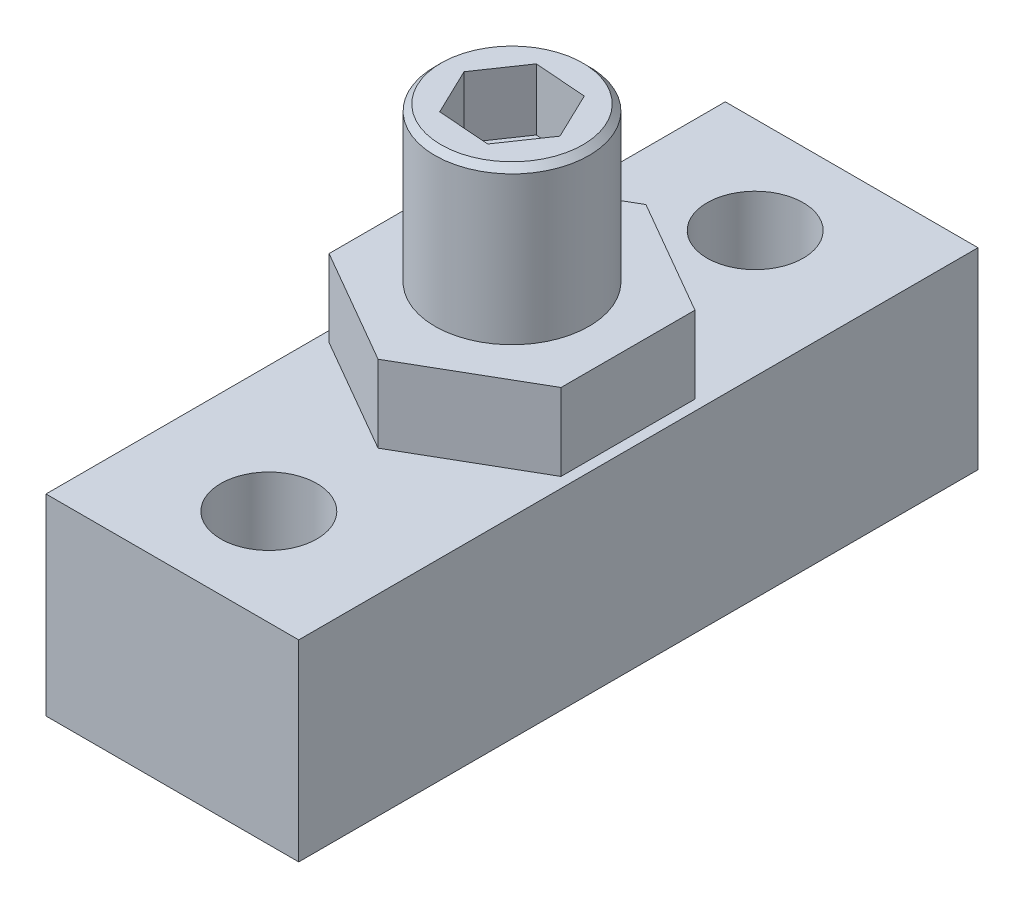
ISO-10303-21;
HEADER;
FILE_DESCRIPTION(('STEP AP214'),'2;1');
FILE_NAME('part.step','',(''),(''),'','','');
FILE_SCHEMA(('AUTOMOTIVE_DESIGN { 1 0 10303 214 1 1 1 1 }'));
ENDSEC;
DATA;
#1=APPLICATION_CONTEXT('core data for automotive mechanical design processes');
#2=APPLICATION_PROTOCOL_DEFINITION('international standard','automotive_design',2000,#1);
#3=PRODUCT_CONTEXT('',#1,'mechanical');
#4=PRODUCT('Part','Part','',(#3));
#5=PRODUCT_RELATED_PRODUCT_CATEGORY('part','',(#4));
#6=PRODUCT_DEFINITION_FORMATION('','',#4);
#7=PRODUCT_DEFINITION_CONTEXT('part definition',#1,'design');
#8=PRODUCT_DEFINITION('design','',#6,#7);
#9=PRODUCT_DEFINITION_SHAPE('','',#8);
#10=(LENGTH_UNIT() NAMED_UNIT(*) SI_UNIT(.MILLI.,.METRE.));
#11=(NAMED_UNIT(*) PLANE_ANGLE_UNIT() SI_UNIT($,.RADIAN.));
#12=(NAMED_UNIT(*) SI_UNIT($,.STERADIAN.) SOLID_ANGLE_UNIT());
#13=UNCERTAINTY_MEASURE_WITH_UNIT(LENGTH_MEASURE(1.E-05),#10,'distance_accuracy_value','');
#14=(GEOMETRIC_REPRESENTATION_CONTEXT(3) GLOBAL_UNCERTAINTY_ASSIGNED_CONTEXT((#13)) GLOBAL_UNIT_ASSIGNED_CONTEXT((#10,
#11,#12)) REPRESENTATION_CONTEXT('',''));
#15=CARTESIAN_POINT('',(0.,0.,0.));
#16=DIRECTION('',(0.,0.,1.));
#17=DIRECTION('',(1.,0.,0.));
#18=AXIS2_PLACEMENT_3D('',#15,#16,#17);
#19=CARTESIAN_POINT('',(0.,7.1374,5.51860215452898));
#20=DIRECTION('',(0.,1.,0.));
#21=DIRECTION('',(0.,0.,1.));
#22=AXIS2_PLACEMENT_3D('',#19,#20,#21);
#23=PLANE('',#22);
#24=DIRECTION('',(0.866025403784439,0.,0.5));
#25=VECTOR('',#24,1.);
#26=CARTESIAN_POINT('',(-4.77924965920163,7.1374,2.75930107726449));
#27=LINE('',#26,#25);
#28=CARTESIAN_POINT('',(-4.77924965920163,7.1374,2.75930107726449));
#29=VERTEX_POINT('',#28);
#30=CARTESIAN_POINT('',(0.,7.1374,5.51860215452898));
#31=VERTEX_POINT('',#30);
#32=EDGE_CURVE('E216',#29,#31,#27,.T.);
#33=ORIENTED_EDGE('',*,*,#32,.T.);
#34=DIRECTION('',(0.866025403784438,0.,-0.500000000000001));
#35=VECTOR('',#34,1.);
#36=CARTESIAN_POINT('',(0.,7.1374,5.51860215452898));
#37=LINE('',#36,#35);
#38=CARTESIAN_POINT('',(4.77924965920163,7.1374,2.75930107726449));
#39=VERTEX_POINT('',#38);
#40=EDGE_CURVE('E219',#31,#39,#37,.T.);
#41=ORIENTED_EDGE('',*,*,#40,.T.);
#42=DIRECTION('',(0.,0.,-1.));
#43=VECTOR('',#42,1.);
#44=CARTESIAN_POINT('',(4.77924965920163,7.1374,2.75930107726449));
#45=LINE('',#44,#43);
#46=CARTESIAN_POINT('',(4.77924965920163,7.1374,-2.75930107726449));
#47=VERTEX_POINT('',#46);
#48=EDGE_CURVE('E221',#39,#47,#45,.T.);
#49=ORIENTED_EDGE('',*,*,#48,.T.);
#50=DIRECTION('',(-0.866025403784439,0.,-0.5));
#51=VECTOR('',#50,1.);
#52=CARTESIAN_POINT('',(4.77924965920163,7.1374,-2.75930107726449));
#53=LINE('',#52,#51);
#54=CARTESIAN_POINT('',(0.,7.1374,-5.51860215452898));
#55=VERTEX_POINT('',#54);
#56=EDGE_CURVE('E223',#47,#55,#53,.T.);
#57=ORIENTED_EDGE('',*,*,#56,.T.);
#58=DIRECTION('',(-0.866025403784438,0.,0.500000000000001));
#59=VECTOR('',#58,1.);
#60=CARTESIAN_POINT('',(0.,7.1374,-5.51860215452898));
#61=LINE('',#60,#59);
#62=CARTESIAN_POINT('',(-4.77924965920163,7.1374,-2.75930107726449));
#63=VERTEX_POINT('',#62);
#64=EDGE_CURVE('E225',#55,#63,#61,.T.);
#65=ORIENTED_EDGE('',*,*,#64,.T.);
#66=DIRECTION('',(0.,0.,1.));
#67=VECTOR('',#66,1.);
#68=CARTESIAN_POINT('',(-4.77924965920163,7.1374,-2.75930107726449));
#69=LINE('',#68,#67);
#70=EDGE_CURVE('E227',#63,#29,#69,.T.);
#71=ORIENTED_EDGE('',*,*,#70,.T.);
#72=EDGE_LOOP('',(#33,#41,#49,#57,#65,#71));
#73=FACE_BOUND('',#72,.T.);
#74=CARTESIAN_POINT('',(0.,7.1374,0.));
#75=DIRECTION('',(0.,1.,0.));
#76=DIRECTION('',(0.,0.,1.));
#77=AXIS2_PLACEMENT_3D('',#74,#75,#76);
#78=CIRCLE('',#77,3.175);
#79=CARTESIAN_POINT('',(0.,7.1374,3.175));
#80=VERTEX_POINT('',#79);
#81=EDGE_CURVE('E194',#80,#80,#78,.T.);
#82=ORIENTED_EDGE('',*,*,#81,.F.);
#83=EDGE_LOOP('',(#82));
#84=FACE_BOUND('',#83,.T.);
#85=ADVANCED_FACE('F30',(#73,#84),#23,.T.);
#86=CARTESIAN_POINT('',(-5.207,3.9624,13.9954));
#87=DIRECTION('',(0.,1.,0.));
#88=DIRECTION('',(0.,0.,1.));
#89=AXIS2_PLACEMENT_3D('',#86,#87,#88);
#90=PLANE('',#89);
#91=DIRECTION('',(0.,0.,1.));
#92=VECTOR('',#91,1.);
#93=CARTESIAN_POINT('',(-5.207,3.9624,-13.9954));
#94=LINE('',#93,#92);
#95=CARTESIAN_POINT('',(-5.207,3.9624,-13.9954));
#96=VERTEX_POINT('',#95);
#97=CARTESIAN_POINT('',(-5.207,3.9624,13.9954));
#98=VERTEX_POINT('',#97);
#99=EDGE_CURVE('E265',#96,#98,#94,.T.);
#100=ORIENTED_EDGE('',*,*,#99,.T.);
#101=DIRECTION('',(1.,0.,0.));
#102=VECTOR('',#101,1.);
#103=CARTESIAN_POINT('',(-5.207,3.9624,13.9954));
#104=LINE('',#103,#102);
#105=CARTESIAN_POINT('',(5.207,3.9624,13.9954));
#106=VERTEX_POINT('',#105);
#107=EDGE_CURVE('E268',#98,#106,#104,.T.);
#108=ORIENTED_EDGE('',*,*,#107,.T.);
#109=DIRECTION('',(0.,0.,-1.));
#110=VECTOR('',#109,1.);
#111=CARTESIAN_POINT('',(5.207,3.9624,-13.9954));
#112=LINE('',#111,#110);
#113=CARTESIAN_POINT('',(5.207,3.9624,-13.9954));
#114=VERTEX_POINT('',#113);
#115=EDGE_CURVE('E270',#106,#114,#112,.T.);
#116=ORIENTED_EDGE('',*,*,#115,.T.);
#117=DIRECTION('',(-1.,0.,0.));
#118=VECTOR('',#117,1.);
#119=CARTESIAN_POINT('',(-5.207,3.9624,-13.9954));
#120=LINE('',#119,#118);
#121=EDGE_CURVE('E272',#114,#96,#120,.T.);
#122=ORIENTED_EDGE('',*,*,#121,.T.);
#123=EDGE_LOOP('',(#100,#108,#116,#122));
#124=FACE_BOUND('',#123,.T.);
#125=CARTESIAN_POINT('',(0.,3.9624,10.0203));
#126=DIRECTION('',(0.,1.,0.));
#127=DIRECTION('',(0.,0.,1.));
#128=AXIS2_PLACEMENT_3D('',#125,#126,#127);
#129=CIRCLE('',#128,1.9812);
#130=CARTESIAN_POINT('',(0.,3.9624,12.0015));
#131=VERTEX_POINT('',#130);
#132=EDGE_CURVE('E250',#131,#131,#129,.T.);
#133=ORIENTED_EDGE('',*,*,#132,.F.);
#134=EDGE_LOOP('',(#133));
#135=FACE_BOUND('',#134,.T.);
#136=CARTESIAN_POINT('',(0.,3.9624,-10.0203));
#137=DIRECTION('',(0.,1.,0.));
#138=DIRECTION('',(0.,0.,1.));
#139=AXIS2_PLACEMENT_3D('',#136,#137,#138);
#140=CIRCLE('',#139,1.9812);
#141=CARTESIAN_POINT('',(0.,3.9624,-8.0391));
#142=VERTEX_POINT('',#141);
#143=EDGE_CURVE('E244',#142,#142,#140,.T.);
#144=ORIENTED_EDGE('',*,*,#143,.F.);
#145=EDGE_LOOP('',(#144));
#146=FACE_BOUND('',#145,.T.);
#147=DIRECTION('',(0.866025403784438,0.,-0.500000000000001));
#148=VECTOR('',#147,1.);
#149=CARTESIAN_POINT('',(0.,3.9624,5.51860215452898));
#150=LINE('',#149,#148);
#151=CARTESIAN_POINT('',(0.,3.9624,5.51860215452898));
#152=VERTEX_POINT('',#151);
#153=CARTESIAN_POINT('',(4.77924965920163,3.9624,2.75930107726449));
#154=VERTEX_POINT('',#153);
#155=EDGE_CURVE('E206',#152,#154,#150,.T.);
#156=ORIENTED_EDGE('',*,*,#155,.F.);
#157=DIRECTION('',(0.866025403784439,0.,0.5));
#158=VECTOR('',#157,1.);
#159=CARTESIAN_POINT('',(-4.77924965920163,3.9624,2.75930107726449));
#160=LINE('',#159,#158);
#161=CARTESIAN_POINT('',(-4.77924965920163,3.9624,2.75930107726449));
#162=VERTEX_POINT('',#161);
#163=EDGE_CURVE('E203',#162,#152,#160,.T.);
#164=ORIENTED_EDGE('',*,*,#163,.F.);
#165=DIRECTION('',(0.,0.,1.));
#166=VECTOR('',#165,1.);
#167=CARTESIAN_POINT('',(-4.77924965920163,3.9624,-2.75930107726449));
#168=LINE('',#167,#166);
#169=CARTESIAN_POINT('',(-4.77924965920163,3.9624,-2.75930107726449));
#170=VERTEX_POINT('',#169);
#171=EDGE_CURVE('E214',#170,#162,#168,.T.);
#172=ORIENTED_EDGE('',*,*,#171,.F.);
#173=DIRECTION('',(-0.866025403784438,0.,0.500000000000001));
#174=VECTOR('',#173,1.);
#175=CARTESIAN_POINT('',(0.,3.9624,-5.51860215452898));
#176=LINE('',#175,#174);
#177=CARTESIAN_POINT('',(0.,3.9624,-5.51860215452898));
#178=VERTEX_POINT('',#177);
#179=EDGE_CURVE('E212',#178,#170,#176,.T.);
#180=ORIENTED_EDGE('',*,*,#179,.F.);
#181=DIRECTION('',(-0.866025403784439,0.,-0.5));
#182=VECTOR('',#181,1.);
#183=CARTESIAN_POINT('',(4.77924965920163,3.9624,-2.75930107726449));
#184=LINE('',#183,#182);
#185=CARTESIAN_POINT('',(4.77924965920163,3.9624,-2.75930107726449));
#186=VERTEX_POINT('',#185);
#187=EDGE_CURVE('E210',#186,#178,#184,.T.);
#188=ORIENTED_EDGE('',*,*,#187,.F.);
#189=DIRECTION('',(0.,0.,-1.));
#190=VECTOR('',#189,1.);
#191=CARTESIAN_POINT('',(4.77924965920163,3.9624,2.75930107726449));
#192=LINE('',#191,#190);
#193=EDGE_CURVE('E208',#154,#186,#192,.T.);
#194=ORIENTED_EDGE('',*,*,#193,.F.);
#195=EDGE_LOOP('',(#156,#164,#172,#180,#188,#194));
#196=FACE_BOUND('',#195,.T.);
#197=ADVANCED_FACE('F301',(#124,#135,#146,#196),#90,.T.);
#198=CARTESIAN_POINT('',(-5.207,3.9624,-13.9954));
#199=DIRECTION('',(1.,0.,0.));
#200=DIRECTION('',(0.,0.,-1.));
#201=AXIS2_PLACEMENT_3D('',#198,#199,#200);
#202=PLANE('',#201);
#203=DIRECTION('',(0.,0.,1.));
#204=VECTOR('',#203,1.);
#205=CARTESIAN_POINT('',(-5.207,-3.9624,-13.9954));
#206=LINE('',#205,#204);
#207=CARTESIAN_POINT('',(-5.207,-3.9624,-13.9954));
#208=VERTEX_POINT('',#207);
#209=CARTESIAN_POINT('',(-5.207,-3.9624,13.9954));
#210=VERTEX_POINT('',#209);
#211=EDGE_CURVE('E256',#208,#210,#206,.T.);
#212=ORIENTED_EDGE('',*,*,#211,.T.);
#213=DIRECTION('',(0.,-1.,0.));
#214=VECTOR('',#213,1.);
#215=CARTESIAN_POINT('',(-5.207,3.9624,13.9954));
#216=LINE('',#215,#214);
#217=EDGE_CURVE('E283',#98,#210,#216,.T.);
#218=ORIENTED_EDGE('',*,*,#217,.F.);
#219=ORIENTED_EDGE('',*,*,#99,.F.);
#220=DIRECTION('',(0.,-1.,0.));
#221=VECTOR('',#220,1.);
#222=CARTESIAN_POINT('',(-5.207,3.9624,-13.9954));
#223=LINE('',#222,#221);
#224=EDGE_CURVE('E274',#96,#208,#223,.T.);
#225=ORIENTED_EDGE('',*,*,#224,.T.);
#226=EDGE_LOOP('',(#212,#218,#219,#225));
#227=FACE_BOUND('',#226,.T.);
#228=ADVANCED_FACE('F32',(#227),#202,.F.);
#229=CARTESIAN_POINT('',(-5.207,3.9624,13.9954));
#230=DIRECTION('',(0.,0.,-1.));
#231=DIRECTION('',(-1.,0.,0.));
#232=AXIS2_PLACEMENT_3D('',#229,#230,#231);
#233=PLANE('',#232);
#234=DIRECTION('',(1.,0.,0.));
#235=VECTOR('',#234,1.);
#236=CARTESIAN_POINT('',(-5.207,-3.9624,13.9954));
#237=LINE('',#236,#235);
#238=CARTESIAN_POINT('',(5.207,-3.9624,13.9954));
#239=VERTEX_POINT('',#238);
#240=EDGE_CURVE('E259',#210,#239,#237,.T.);
#241=ORIENTED_EDGE('',*,*,#240,.T.);
#242=DIRECTION('',(0.,-1.,0.));
#243=VECTOR('',#242,1.);
#244=CARTESIAN_POINT('',(5.207,3.9624,13.9954));
#245=LINE('',#244,#243);
#246=EDGE_CURVE('E280',#106,#239,#245,.T.);
#247=ORIENTED_EDGE('',*,*,#246,.F.);
#248=ORIENTED_EDGE('',*,*,#107,.F.);
#249=ORIENTED_EDGE('',*,*,#217,.T.);
#250=EDGE_LOOP('',(#241,#247,#248,#249));
#251=FACE_BOUND('',#250,.T.);
#252=ADVANCED_FACE('F355',(#251),#233,.F.);
#253=CARTESIAN_POINT('',(5.207,3.9624,-13.9954));
#254=DIRECTION('',(-1.,0.,0.));
#255=DIRECTION('',(0.,0.,1.));
#256=AXIS2_PLACEMENT_3D('',#253,#254,#255);
#257=PLANE('',#256);
#258=DIRECTION('',(0.,0.,-1.));
#259=VECTOR('',#258,1.);
#260=CARTESIAN_POINT('',(5.207,-3.9624,-13.9954));
#261=LINE('',#260,#259);
#262=CARTESIAN_POINT('',(5.207,-3.9624,-13.9954));
#263=VERTEX_POINT('',#262);
#264=EDGE_CURVE('E261',#239,#263,#261,.T.);
#265=ORIENTED_EDGE('',*,*,#264,.T.);
#266=DIRECTION('',(0.,-1.,0.));
#267=VECTOR('',#266,1.);
#268=CARTESIAN_POINT('',(5.207,3.9624,-13.9954));
#269=LINE('',#268,#267);
#270=EDGE_CURVE('E277',#114,#263,#269,.T.);
#271=ORIENTED_EDGE('',*,*,#270,.F.);
#272=ORIENTED_EDGE('',*,*,#115,.F.);
#273=ORIENTED_EDGE('',*,*,#246,.T.);
#274=EDGE_LOOP('',(#265,#271,#272,#273));
#275=FACE_BOUND('',#274,.T.);
#276=ADVANCED_FACE('F352',(#275),#257,.F.);
#277=CARTESIAN_POINT('',(-5.207,3.9624,-13.9954));
#278=DIRECTION('',(0.,0.,1.));
#279=DIRECTION('',(1.,0.,0.));
#280=AXIS2_PLACEMENT_3D('',#277,#278,#279);
#281=PLANE('',#280);
#282=DIRECTION('',(-1.,0.,0.));
#283=VECTOR('',#282,1.);
#284=CARTESIAN_POINT('',(-5.207,-3.9624,-13.9954));
#285=LINE('',#284,#283);
#286=EDGE_CURVE('E263',#263,#208,#285,.T.);
#287=ORIENTED_EDGE('',*,*,#286,.T.);
#288=ORIENTED_EDGE('',*,*,#224,.F.);
#289=ORIENTED_EDGE('',*,*,#121,.F.);
#290=ORIENTED_EDGE('',*,*,#270,.T.);
#291=EDGE_LOOP('',(#287,#288,#289,#290));
#292=FACE_BOUND('',#291,.T.);
#293=ADVANCED_FACE('F347',(#292),#281,.F.);
#294=CARTESIAN_POINT('',(-5.207,-3.9624,13.9954));
#295=DIRECTION('',(0.,1.,0.));
#296=DIRECTION('',(0.,0.,1.));
#297=AXIS2_PLACEMENT_3D('',#294,#295,#296);
#298=PLANE('',#297);
#299=CARTESIAN_POINT('',(0.,-3.9624,-10.0203));
#300=DIRECTION('',(0.,1.,0.));
#301=DIRECTION('',(0.,0.,1.));
#302=AXIS2_PLACEMENT_3D('',#299,#300,#301);
#303=CIRCLE('',#302,1.9812);
#304=CARTESIAN_POINT('',(0.,-3.9624,-8.0391));
#305=VERTEX_POINT('',#304);
#306=EDGE_CURVE('E247',#305,#305,#303,.T.);
#307=ORIENTED_EDGE('',*,*,#306,.T.);
#308=EDGE_LOOP('',(#307));
#309=FACE_BOUND('',#308,.T.);
#310=CARTESIAN_POINT('',(0.,-3.9624,10.0203));
#311=DIRECTION('',(0.,1.,0.));
#312=DIRECTION('',(0.,0.,1.));
#313=AXIS2_PLACEMENT_3D('',#310,#311,#312);
#314=CIRCLE('',#313,1.9812);
#315=CARTESIAN_POINT('',(0.,-3.9624,12.0015));
#316=VERTEX_POINT('',#315);
#317=EDGE_CURVE('E253',#316,#316,#314,.T.);
#318=ORIENTED_EDGE('',*,*,#317,.T.);
#319=EDGE_LOOP('',(#318));
#320=FACE_BOUND('',#319,.T.);
#321=ORIENTED_EDGE('',*,*,#211,.F.);
#322=ORIENTED_EDGE('',*,*,#286,.F.);
#323=ORIENTED_EDGE('',*,*,#264,.F.);
#324=ORIENTED_EDGE('',*,*,#240,.F.);
#325=EDGE_LOOP('',(#321,#322,#323,#324));
#326=FACE_BOUND('',#325,.T.);
#327=ADVANCED_FACE('F344',(#309,#320,#326),#298,.F.);
#328=CARTESIAN_POINT('',(0.,-3.9624,10.0203));
#329=DIRECTION('',(0.,1.,0.));
#330=DIRECTION('',(0.,0.,1.));
#331=AXIS2_PLACEMENT_3D('',#328,#329,#330);
#332=CYLINDRICAL_SURFACE('',#331,1.9812);
#333=ORIENTED_EDGE('',*,*,#317,.F.);
#334=EDGE_LOOP('',(#333));
#335=FACE_BOUND('',#334,.T.);
#336=ORIENTED_EDGE('',*,*,#132,.T.);
#337=EDGE_LOOP('',(#336));
#338=FACE_BOUND('',#337,.T.);
#339=ADVANCED_FACE('F340',(#335,#338),#332,.F.);
#340=CARTESIAN_POINT('',(0.,-3.9624,-10.0203));
#341=DIRECTION('',(0.,1.,0.));
#342=DIRECTION('',(0.,0.,1.));
#343=AXIS2_PLACEMENT_3D('',#340,#341,#342);
#344=CYLINDRICAL_SURFACE('',#343,1.9812);
#345=ORIENTED_EDGE('',*,*,#306,.F.);
#346=EDGE_LOOP('',(#345));
#347=FACE_BOUND('',#346,.T.);
#348=ORIENTED_EDGE('',*,*,#143,.T.);
#349=EDGE_LOOP('',(#348));
#350=FACE_BOUND('',#349,.T.);
#351=ADVANCED_FACE('F336',(#347,#350),#344,.F.);
#352=CARTESIAN_POINT('',(-4.77924965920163,7.1374,2.75930107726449));
#353=DIRECTION('',(0.5,0.,-0.866025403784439));
#354=DIRECTION('',(-0.866025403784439,0.,-0.5));
#355=AXIS2_PLACEMENT_3D('',#352,#353,#354);
#356=PLANE('',#355);
#357=ORIENTED_EDGE('',*,*,#163,.T.);
#358=DIRECTION('',(0.,-1.,0.));
#359=VECTOR('',#358,1.);
#360=CARTESIAN_POINT('',(0.,7.1374,5.51860215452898));
#361=LINE('',#360,#359);
#362=EDGE_CURVE('E242',#31,#152,#361,.T.);
#363=ORIENTED_EDGE('',*,*,#362,.F.);
#364=ORIENTED_EDGE('',*,*,#32,.F.);
#365=DIRECTION('',(0.,-1.,0.));
#366=VECTOR('',#365,1.);
#367=CARTESIAN_POINT('',(-4.77924965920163,7.1374,2.75930107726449));
#368=LINE('',#367,#366);
#369=EDGE_CURVE('E229',#29,#162,#368,.T.);
#370=ORIENTED_EDGE('',*,*,#369,.T.);
#371=EDGE_LOOP('',(#357,#363,#364,#370));
#372=FACE_BOUND('',#371,.T.);
#373=ADVANCED_FACE('F332',(#372),#356,.F.);
#374=CARTESIAN_POINT('',(0.,7.1374,5.51860215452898));
#375=DIRECTION('',(-0.500000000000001,0.,-0.866025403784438));
#376=DIRECTION('',(-0.866025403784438,0.,0.500000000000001));
#377=AXIS2_PLACEMENT_3D('',#374,#375,#376);
#378=PLANE('',#377);
#379=ORIENTED_EDGE('',*,*,#155,.T.);
#380=DIRECTION('',(0.,-1.,0.));
#381=VECTOR('',#380,1.);
#382=CARTESIAN_POINT('',(4.77924965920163,7.1374,2.75930107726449));
#383=LINE('',#382,#381);
#384=EDGE_CURVE('E239',#39,#154,#383,.T.);
#385=ORIENTED_EDGE('',*,*,#384,.F.);
#386=ORIENTED_EDGE('',*,*,#40,.F.);
#387=ORIENTED_EDGE('',*,*,#362,.T.);
#388=EDGE_LOOP('',(#379,#385,#386,#387));
#389=FACE_BOUND('',#388,.T.);
#390=ADVANCED_FACE('F328',(#389),#378,.F.);
#391=CARTESIAN_POINT('',(4.77924965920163,7.1374,2.75930107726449));
#392=DIRECTION('',(-1.,0.,0.));
#393=DIRECTION('',(0.,0.,1.));
#394=AXIS2_PLACEMENT_3D('',#391,#392,#393);
#395=PLANE('',#394);
#396=ORIENTED_EDGE('',*,*,#193,.T.);
#397=DIRECTION('',(0.,-1.,0.));
#398=VECTOR('',#397,1.);
#399=CARTESIAN_POINT('',(4.77924965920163,7.1374,-2.75930107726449));
#400=LINE('',#399,#398);
#401=EDGE_CURVE('E236',#47,#186,#400,.T.);
#402=ORIENTED_EDGE('',*,*,#401,.F.);
#403=ORIENTED_EDGE('',*,*,#48,.F.);
#404=ORIENTED_EDGE('',*,*,#384,.T.);
#405=EDGE_LOOP('',(#396,#402,#403,#404));
#406=FACE_BOUND('',#405,.T.);
#407=ADVANCED_FACE('F324',(#406),#395,.F.);
#408=CARTESIAN_POINT('',(4.77924965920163,7.1374,-2.75930107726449));
#409=DIRECTION('',(-0.5,0.,0.866025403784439));
#410=DIRECTION('',(0.866025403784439,0.,0.5));
#411=AXIS2_PLACEMENT_3D('',#408,#409,#410);
#412=PLANE('',#411);
#413=ORIENTED_EDGE('',*,*,#187,.T.);
#414=DIRECTION('',(0.,-1.,0.));
#415=VECTOR('',#414,1.);
#416=CARTESIAN_POINT('',(0.,7.1374,-5.51860215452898));
#417=LINE('',#416,#415);
#418=EDGE_CURVE('E233',#55,#178,#417,.T.);
#419=ORIENTED_EDGE('',*,*,#418,.F.);
#420=ORIENTED_EDGE('',*,*,#56,.F.);
#421=ORIENTED_EDGE('',*,*,#401,.T.);
#422=EDGE_LOOP('',(#413,#419,#420,#421));
#423=FACE_BOUND('',#422,.T.);
#424=ADVANCED_FACE('F320',(#423),#412,.F.);
#425=CARTESIAN_POINT('',(0.,7.1374,-5.51860215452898));
#426=DIRECTION('',(0.500000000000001,0.,0.866025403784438));
#427=DIRECTION('',(0.866025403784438,0.,-0.500000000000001));
#428=AXIS2_PLACEMENT_3D('',#425,#426,#427);
#429=PLANE('',#428);
#430=ORIENTED_EDGE('',*,*,#179,.T.);
#431=DIRECTION('',(0.,-1.,0.));
#432=VECTOR('',#431,1.);
#433=CARTESIAN_POINT('',(-4.77924965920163,7.1374,-2.75930107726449));
#434=LINE('',#433,#432);
#435=EDGE_CURVE('E53',#63,#170,#434,.T.);
#436=ORIENTED_EDGE('',*,*,#435,.F.);
#437=ORIENTED_EDGE('',*,*,#64,.F.);
#438=ORIENTED_EDGE('',*,*,#418,.T.);
#439=EDGE_LOOP('',(#430,#436,#437,#438));
#440=FACE_BOUND('',#439,.T.);
#441=ADVANCED_FACE('F317',(#440),#429,.F.);
#442=CARTESIAN_POINT('',(-4.77924965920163,7.1374,-2.75930107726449));
#443=DIRECTION('',(1.,0.,0.));
#444=DIRECTION('',(0.,0.,-1.));
#445=AXIS2_PLACEMENT_3D('',#442,#443,#444);
#446=PLANE('',#445);
#447=ORIENTED_EDGE('',*,*,#171,.T.);
#448=ORIENTED_EDGE('',*,*,#369,.F.);
#449=ORIENTED_EDGE('',*,*,#70,.F.);
#450=ORIENTED_EDGE('',*,*,#435,.T.);
#451=EDGE_LOOP('',(#447,#448,#449,#450));
#452=FACE_BOUND('',#451,.T.);
#453=ADVANCED_FACE('F314',(#452),#446,.F.);
#454=CARTESIAN_POINT('',(0.,13.4874,0.));
#455=DIRECTION('',(0.,-1.,0.));
#456=DIRECTION('',(0.,0.,-1.));
#457=AXIS2_PLACEMENT_3D('',#454,#455,#456);
#458=CYLINDRICAL_SURFACE('',#457,3.175);
#459=CARTESIAN_POINT('',(0.,13.2334,0.));
#460=DIRECTION('',(0.,1.,0.));
#461=DIRECTION('',(0.,0.,1.));
#462=AXIS2_PLACEMENT_3D('',#459,#460,#461);
#463=CIRCLE('',#462,3.175);
#464=CARTESIAN_POINT('',(0.,13.2334,3.175));
#465=VERTEX_POINT('',#464);
#466=EDGE_CURVE('E11',#465,#465,#463,.F.);
#467=ORIENTED_EDGE('',*,*,#466,.T.);
#468=EDGE_LOOP('',(#467));
#469=FACE_BOUND('',#468,.T.);
#470=ORIENTED_EDGE('',*,*,#81,.T.);
#471=EDGE_LOOP('',(#470));
#472=FACE_BOUND('',#471,.T.);
#473=ADVANCED_FACE('F312',(#469,#472),#458,.T.);
#474=CARTESIAN_POINT('',(0.,13.4874,0.));
#475=DIRECTION('',(0.,1.,0.));
#476=DIRECTION('',(0.,0.,1.));
#477=AXIS2_PLACEMENT_3D('',#474,#475,#476);
#478=PLANE('',#477);
#479=CARTESIAN_POINT('',(0.,13.4874,0.));
#480=DIRECTION('',(0.,1.,0.));
#481=DIRECTION('',(0.,0.,1.));
#482=AXIS2_PLACEMENT_3D('',#479,#480,#481);
#483=CIRCLE('',#482,2.921);
#484=CARTESIAN_POINT('',(0.,13.4874,2.921));
#485=VERTEX_POINT('',#484);
#486=EDGE_CURVE('E38',#485,#485,#483,.T.);
#487=ORIENTED_EDGE('',*,*,#486,.T.);
#488=EDGE_LOOP('',(#487));
#489=FACE_BOUND('',#488,.T.);
#490=DIRECTION('',(0.433327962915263,0.,0.901236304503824));
#491=VECTOR('',#490,1.);
#492=CARTESIAN_POINT('',(-2.13727430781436,13.4874,-0.161492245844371));
#493=LINE('',#492,#491);
#494=CARTESIAN_POINT('',(-2.13727430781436,13.4874,-0.161492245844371));
#495=VERTEX_POINT('',#494);
#496=CARTESIAN_POINT('',(-1.20849354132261,13.4874,1.77018772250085));
#497=VERTEX_POINT('',#496);
#498=EDGE_CURVE('E45',#495,#497,#493,.T.);
#499=ORIENTED_EDGE('',*,*,#498,.F.);
#500=DIRECTION('',(-0.563829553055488,0.,0.825891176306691));
#501=VECTOR('',#500,1.);
#502=CARTESIAN_POINT('',(-0.928780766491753,13.4874,-1.93167996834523));
#503=LINE('',#502,#501);
#504=CARTESIAN_POINT('',(-0.928780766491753,13.4874,-1.93167996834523));
#505=VERTEX_POINT('',#504);
#506=EDGE_CURVE('E174',#505,#495,#503,.T.);
#507=ORIENTED_EDGE('',*,*,#506,.F.);
#508=DIRECTION('',(-0.997157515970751,0.,-0.075345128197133));
#509=VECTOR('',#508,1.);
#510=CARTESIAN_POINT('',(1.20849354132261,13.4874,-1.77018772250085));
#511=LINE('',#510,#509);
#512=CARTESIAN_POINT('',(1.20849354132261,13.4874,-1.77018772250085));
#513=VERTEX_POINT('',#512);
#514=EDGE_CURVE('E168',#513,#505,#511,.T.);
#515=ORIENTED_EDGE('',*,*,#514,.F.);
#516=DIRECTION('',(-0.433327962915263,0.,-0.901236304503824));
#517=VECTOR('',#516,1.);
#518=CARTESIAN_POINT('',(2.13727430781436,13.4874,0.161492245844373));
#519=LINE('',#518,#517);
#520=CARTESIAN_POINT('',(2.13727430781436,13.4874,0.161492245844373));
#521=VERTEX_POINT('',#520);
#522=EDGE_CURVE('E166',#521,#513,#519,.T.);
#523=ORIENTED_EDGE('',*,*,#522,.F.);
#524=DIRECTION('',(0.563829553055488,0.,-0.825891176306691));
#525=VECTOR('',#524,1.);
#526=CARTESIAN_POINT('',(0.928780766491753,13.4874,1.93167996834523));
#527=LINE('',#526,#525);
#528=CARTESIAN_POINT('',(0.928780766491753,13.4874,1.93167996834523));
#529=VERTEX_POINT('',#528);
#530=EDGE_CURVE('E148',#529,#521,#527,.T.);
#531=ORIENTED_EDGE('',*,*,#530,.F.);
#532=DIRECTION('',(0.997157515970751,0.,0.0753451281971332));
#533=VECTOR('',#532,1.);
#534=CARTESIAN_POINT('',(-1.20849354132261,13.4874,1.77018772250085));
#535=LINE('',#534,#533);
#536=EDGE_CURVE('E159',#497,#529,#535,.T.);
#537=ORIENTED_EDGE('',*,*,#536,.F.);
#538=EDGE_LOOP('',(#499,#507,#515,#523,#531,#537));
#539=FACE_BOUND('',#538,.T.);
#540=ADVANCED_FACE('F163',(#489,#539),#478,.T.);
#541=CARTESIAN_POINT('',(-2.13727430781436,10.9474,-0.161492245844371));
#542=DIRECTION('',(-0.901236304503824,0.,0.433327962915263));
#543=DIRECTION('',(0.433327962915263,0.,0.901236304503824));
#544=AXIS2_PLACEMENT_3D('',#541,#542,#543);
#545=PLANE('',#544);
#546=ORIENTED_EDGE('',*,*,#498,.T.);
#547=DIRECTION('',(0.,1.,0.));
#548=VECTOR('',#547,1.);
#549=CARTESIAN_POINT('',(-1.20849354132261,10.9474,1.77018772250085));
#550=LINE('',#549,#548);
#551=CARTESIAN_POINT('',(-1.20849354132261,10.9474,1.77018772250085));
#552=VERTEX_POINT('',#551);
#553=EDGE_CURVE('E156',#552,#497,#550,.T.);
#554=ORIENTED_EDGE('',*,*,#553,.F.);
#555=DIRECTION('',(0.433327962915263,0.,0.901236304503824));
#556=VECTOR('',#555,1.);
#557=CARTESIAN_POINT('',(-2.13727430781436,10.9474,-0.161492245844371));
#558=LINE('',#557,#556);
#559=CARTESIAN_POINT('',(-2.13727430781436,10.9474,-0.161492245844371));
#560=VERTEX_POINT('',#559);
#561=EDGE_CURVE('E177',#560,#552,#558,.T.);
#562=ORIENTED_EDGE('',*,*,#561,.F.);
#563=DIRECTION('',(0.,1.,0.));
#564=VECTOR('',#563,1.);
#565=CARTESIAN_POINT('',(-2.13727430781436,10.9474,-0.161492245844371));
#566=LINE('',#565,#564);
#567=EDGE_CURVE('E192',#560,#495,#566,.T.);
#568=ORIENTED_EDGE('',*,*,#567,.T.);
#569=EDGE_LOOP('',(#546,#554,#562,#568));
#570=FACE_BOUND('',#569,.T.);
#571=ADVANCED_FACE('F453',(#570),#545,.F.);
#572=CARTESIAN_POINT('',(-0.928780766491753,10.9474,-1.93167996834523));
#573=DIRECTION('',(-0.825891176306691,0.,-0.563829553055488));
#574=DIRECTION('',(-0.563829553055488,0.,0.825891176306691));
#575=AXIS2_PLACEMENT_3D('',#572,#573,#574);
#576=PLANE('',#575);
#577=ORIENTED_EDGE('',*,*,#506,.T.);
#578=ORIENTED_EDGE('',*,*,#567,.F.);
#579=DIRECTION('',(-0.563829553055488,0.,0.825891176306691));
#580=VECTOR('',#579,1.);
#581=CARTESIAN_POINT('',(-0.928780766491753,10.9474,-1.93167996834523));
#582=LINE('',#581,#580);
#583=CARTESIAN_POINT('',(-0.928780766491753,10.9474,-1.93167996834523));
#584=VERTEX_POINT('',#583);
#585=EDGE_CURVE('E189',#584,#560,#582,.T.);
#586=ORIENTED_EDGE('',*,*,#585,.F.);
#587=DIRECTION('',(0.,1.,0.));
#588=VECTOR('',#587,1.);
#589=CARTESIAN_POINT('',(-0.928780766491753,10.9474,-1.93167996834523));
#590=LINE('',#589,#588);
#591=EDGE_CURVE('E195',#584,#505,#590,.T.);
#592=ORIENTED_EDGE('',*,*,#591,.T.);
#593=EDGE_LOOP('',(#577,#578,#586,#592));
#594=FACE_BOUND('',#593,.T.);
#595=ADVANCED_FACE('F458',(#594),#576,.F.);
#596=CARTESIAN_POINT('',(1.20849354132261,10.9474,-1.77018772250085));
#597=DIRECTION('',(0.075345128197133,0.,-0.997157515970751));
#598=DIRECTION('',(-0.997157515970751,0.,-0.075345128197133));
#599=AXIS2_PLACEMENT_3D('',#596,#597,#598);
#600=PLANE('',#599);
#601=ORIENTED_EDGE('',*,*,#514,.T.);
#602=ORIENTED_EDGE('',*,*,#591,.F.);
#603=DIRECTION('',(-0.997157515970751,0.,-0.075345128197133));
#604=VECTOR('',#603,1.);
#605=CARTESIAN_POINT('',(1.20849354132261,10.9474,-1.77018772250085));
#606=LINE('',#605,#604);
#607=CARTESIAN_POINT('',(1.20849354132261,10.9474,-1.77018772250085));
#608=VERTEX_POINT('',#607);
#609=EDGE_CURVE('E186',#608,#584,#606,.T.);
#610=ORIENTED_EDGE('',*,*,#609,.F.);
#611=DIRECTION('',(0.,1.,0.));
#612=VECTOR('',#611,1.);
#613=CARTESIAN_POINT('',(1.20849354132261,10.9474,-1.77018772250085));
#614=LINE('',#613,#612);
#615=EDGE_CURVE('E197',#608,#513,#614,.T.);
#616=ORIENTED_EDGE('',*,*,#615,.T.);
#617=EDGE_LOOP('',(#601,#602,#610,#616));
#618=FACE_BOUND('',#617,.T.);
#619=ADVANCED_FACE('F469',(#618),#600,.F.);
#620=CARTESIAN_POINT('',(2.13727430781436,10.9474,0.161492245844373));
#621=DIRECTION('',(0.901236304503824,0.,-0.433327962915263));
#622=DIRECTION('',(-0.433327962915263,0.,-0.901236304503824));
#623=AXIS2_PLACEMENT_3D('',#620,#621,#622);
#624=PLANE('',#623);
#625=ORIENTED_EDGE('',*,*,#522,.T.);
#626=ORIENTED_EDGE('',*,*,#615,.F.);
#627=DIRECTION('',(-0.433327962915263,0.,-0.901236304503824));
#628=VECTOR('',#627,1.);
#629=CARTESIAN_POINT('',(2.13727430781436,10.9474,0.161492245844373));
#630=LINE('',#629,#628);
#631=CARTESIAN_POINT('',(2.13727430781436,10.9474,0.161492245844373));
#632=VERTEX_POINT('',#631);
#633=EDGE_CURVE('E183',#632,#608,#630,.T.);
#634=ORIENTED_EDGE('',*,*,#633,.F.);
#635=DIRECTION('',(0.,1.,0.));
#636=VECTOR('',#635,1.);
#637=CARTESIAN_POINT('',(2.13727430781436,10.9474,0.161492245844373));
#638=LINE('',#637,#636);
#639=EDGE_CURVE('E155',#632,#521,#638,.T.);
#640=ORIENTED_EDGE('',*,*,#639,.T.);
#641=EDGE_LOOP('',(#625,#626,#634,#640));
#642=FACE_BOUND('',#641,.T.);
#643=ADVANCED_FACE('F479',(#642),#624,.F.);
#644=CARTESIAN_POINT('',(0.928780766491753,10.9474,1.93167996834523));
#645=DIRECTION('',(0.82589117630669,0.,0.563829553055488));
#646=DIRECTION('',(0.563829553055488,0.,-0.825891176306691));
#647=AXIS2_PLACEMENT_3D('',#644,#645,#646);
#648=PLANE('',#647);
#649=ORIENTED_EDGE('',*,*,#530,.T.);
#650=ORIENTED_EDGE('',*,*,#639,.F.);
#651=DIRECTION('',(0.563829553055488,0.,-0.825891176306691));
#652=VECTOR('',#651,1.);
#653=CARTESIAN_POINT('',(0.928780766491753,10.9474,1.93167996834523));
#654=LINE('',#653,#652);
#655=CARTESIAN_POINT('',(0.928780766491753,10.9474,1.93167996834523));
#656=VERTEX_POINT('',#655);
#657=EDGE_CURVE('E151',#656,#632,#654,.T.);
#658=ORIENTED_EDGE('',*,*,#657,.F.);
#659=DIRECTION('',(0.,1.,0.));
#660=VECTOR('',#659,1.);
#661=CARTESIAN_POINT('',(0.928780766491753,10.9474,1.93167996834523));
#662=LINE('',#661,#660);
#663=EDGE_CURVE('E144',#656,#529,#662,.T.);
#664=ORIENTED_EDGE('',*,*,#663,.T.);
#665=EDGE_LOOP('',(#649,#650,#658,#664));
#666=FACE_BOUND('',#665,.T.);
#667=ADVANCED_FACE('F146',(#666),#648,.F.);
#668=CARTESIAN_POINT('',(-1.20849354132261,10.9474,1.77018772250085));
#669=DIRECTION('',(-0.0753451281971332,0.,0.997157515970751));
#670=DIRECTION('',(0.997157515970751,0.,0.0753451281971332));
#671=AXIS2_PLACEMENT_3D('',#668,#669,#670);
#672=PLANE('',#671);
#673=ORIENTED_EDGE('',*,*,#536,.T.);
#674=ORIENTED_EDGE('',*,*,#663,.F.);
#675=DIRECTION('',(0.997157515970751,0.,0.0753451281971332));
#676=VECTOR('',#675,1.);
#677=CARTESIAN_POINT('',(-1.20849354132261,10.9474,1.77018772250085));
#678=LINE('',#677,#676);
#679=EDGE_CURVE('E180',#552,#656,#678,.T.);
#680=ORIENTED_EDGE('',*,*,#679,.F.);
#681=ORIENTED_EDGE('',*,*,#553,.T.);
#682=EDGE_LOOP('',(#673,#674,#680,#681));
#683=FACE_BOUND('',#682,.T.);
#684=ADVANCED_FACE('F160',(#683),#672,.F.);
#685=CARTESIAN_POINT('',(-3.06605507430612,10.9474,-2.0931722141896));
#686=DIRECTION('',(0.,-1.,0.));
#687=DIRECTION('',(0.,0.,-1.));
#688=AXIS2_PLACEMENT_3D('',#685,#686,#687);
#689=PLANE('',#688);
#690=ORIENTED_EDGE('',*,*,#561,.T.);
#691=ORIENTED_EDGE('',*,*,#679,.T.);
#692=ORIENTED_EDGE('',*,*,#657,.T.);
#693=ORIENTED_EDGE('',*,*,#633,.T.);
#694=ORIENTED_EDGE('',*,*,#609,.T.);
#695=ORIENTED_EDGE('',*,*,#585,.T.);
#696=EDGE_LOOP('',(#690,#691,#692,#693,#694,#695));
#697=FACE_BOUND('',#696,.T.);
#698=ADVANCED_FACE('F291',(#697),#689,.F.);
#699=CARTESIAN_POINT('',(0.,13.4874,0.));
#700=DIRECTION('',(0.,-1.,0.));
#701=DIRECTION('',(0.,0.,-1.));
#702=AXIS2_PLACEMENT_3D('',#699,#700,#701);
#703=CONICAL_SURFACE('',#702,2.921,0.785398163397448);
#704=ORIENTED_EDGE('',*,*,#466,.F.);
#705=EDGE_LOOP('',(#704));
#706=FACE_BOUND('',#705,.T.);
#707=ORIENTED_EDGE('',*,*,#486,.F.);
#708=EDGE_LOOP('',(#707));
#709=FACE_BOUND('',#708,.T.);
#710=ADVANCED_FACE('F289',(#706,#709),#703,.T.);
#711=CLOSED_SHELL('',(#85,#197,#228,#252,#276,#293,#327,#339,#351,#373,#390,#407,#424,#441,#453,
#473,#540,#571,#595,#619,#643,#667,#684,#698,#710));
#712=MANIFOLD_SOLID_BREP('B2',#711);
#713=ADVANCED_BREP_SHAPE_REPRESENTATION('',(#18,#712),#14);
#714=SHAPE_DEFINITION_REPRESENTATION(#9,#713);
ENDSEC;
END-ISO-10303-21;
